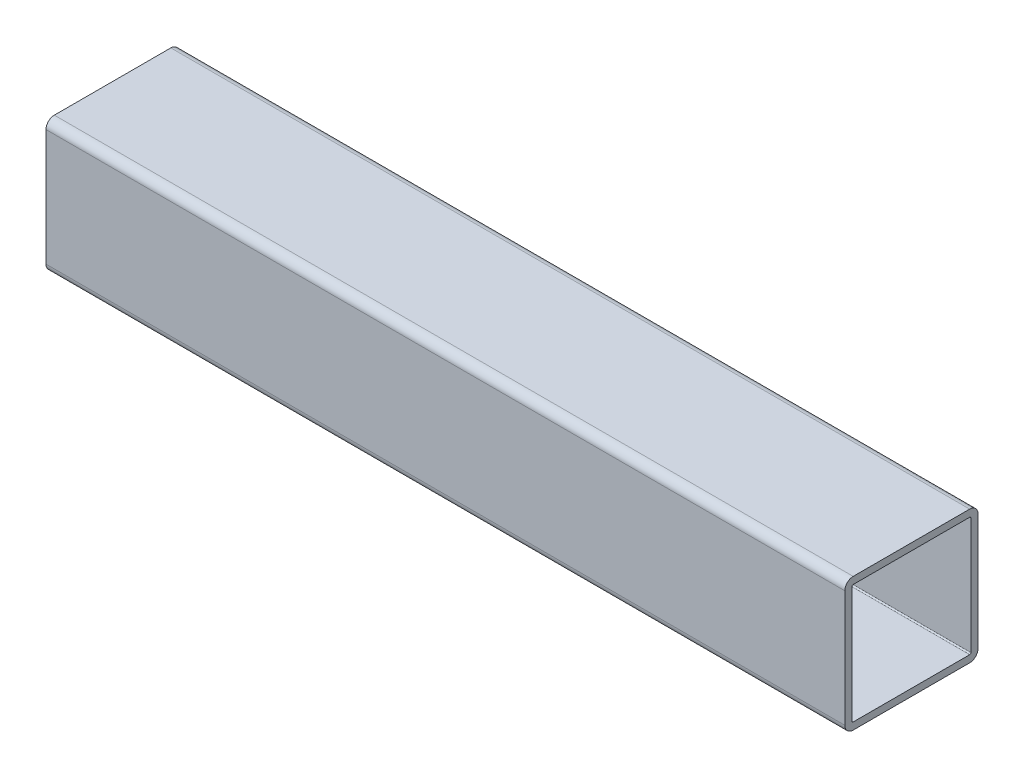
from build123d import *

# Parameters (mm, degrees)
EXTRUDE1_DEPTH = 152.4


with BuildPart() as part:
    # Sketch1 → Extrude1 (new body)
    with BuildSketch(Plane(origin=(0, 0, 0), x_dir=(0, 0, -1), z_dir=(1, 0, 0))):
        with BuildLine():
            Line((-5.373037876, 5.244240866), (16.851962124, 5.244240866))
            ThreePointArc((16.851962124, 5.244240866), (17.974494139, 4.779272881), (18.439462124, 3.656740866))
            Line((18.439462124, 3.656740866), (18.439462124, -18.568259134))
            ThreePointArc((18.439462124, -18.568259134), (17.974494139, -19.690791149), (16.851962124, -20.155759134))
            Line((16.851962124, -20.155759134), (-5.373037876, -20.155759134))
            ThreePointArc((-5.373037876, -20.155759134), (-6.495569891, -19.690791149), (-6.960537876, -18.568259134))
            Line((-6.960537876, -18.568259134), (-6.960537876, 3.656740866))
            ThreePointArc((-6.960537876, 3.656740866), (-6.495569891, 4.779272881), (-5.373037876, 5.244240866))
        make_face()
        with BuildLine():
            Line((-5.373037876, 3.898040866), (16.851962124, 3.898040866))
            ThreePointArc((16.851962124, 3.898040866), (17.02258699, 3.827365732), (17.093262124, 3.656740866))
            Line((17.093262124, 3.656740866), (17.093262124, -18.568259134))
            ThreePointArc((17.093262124, -18.568259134), (17.02258699, -18.738884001), (16.851962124, -18.809559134))
            Line((16.851962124, -18.809559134), (-5.373037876, -18.809559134))
            ThreePointArc((-5.373037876, -18.809559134), (-5.543662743, -18.738884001), (-5.614337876, -18.568259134))
            Line((-5.614337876, -18.568259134), (-5.614337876, 3.656740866))
            ThreePointArc((-5.614337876, 3.656740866), (-5.543662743, 3.827365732), (-5.373037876, 3.898040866))
        make_face(mode=Mode.SUBTRACT)
    extrude(amount=EXTRUDE1_DEPTH)


solid = part.part
